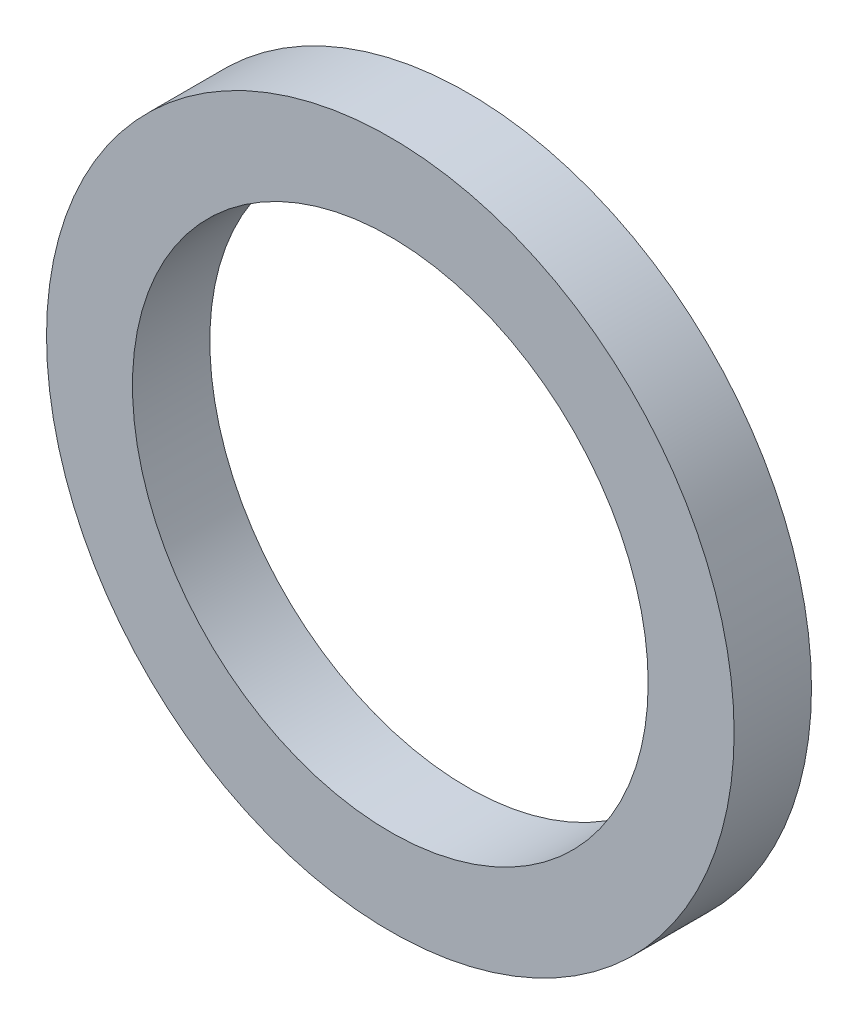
ISO-10303-21;
HEADER;
FILE_DESCRIPTION(('STEP AP214'),'2;1');
FILE_NAME('part.step','',(''),(''),'','','');
FILE_SCHEMA(('AUTOMOTIVE_DESIGN { 1 0 10303 214 1 1 1 1 }'));
ENDSEC;
DATA;
#1=APPLICATION_CONTEXT('core data for automotive mechanical design processes');
#2=APPLICATION_PROTOCOL_DEFINITION('international standard','automotive_design',2000,#1);
#3=PRODUCT_CONTEXT('',#1,'mechanical');
#4=PRODUCT('Part','Part','',(#3));
#5=PRODUCT_RELATED_PRODUCT_CATEGORY('part','',(#4));
#6=PRODUCT_DEFINITION_FORMATION('','',#4);
#7=PRODUCT_DEFINITION_CONTEXT('part definition',#1,'design');
#8=PRODUCT_DEFINITION('design','',#6,#7);
#9=PRODUCT_DEFINITION_SHAPE('','',#8);
#10=(LENGTH_UNIT() NAMED_UNIT(*) SI_UNIT(.MILLI.,.METRE.));
#11=(NAMED_UNIT(*) PLANE_ANGLE_UNIT() SI_UNIT($,.RADIAN.));
#12=(NAMED_UNIT(*) SI_UNIT($,.STERADIAN.) SOLID_ANGLE_UNIT());
#13=UNCERTAINTY_MEASURE_WITH_UNIT(LENGTH_MEASURE(1.E-05),#10,'distance_accuracy_value','');
#14=(GEOMETRIC_REPRESENTATION_CONTEXT(3) GLOBAL_UNCERTAINTY_ASSIGNED_CONTEXT((#13)) GLOBAL_UNIT_ASSIGNED_CONTEXT((#10,
#11,#12)) REPRESENTATION_CONTEXT('',''));
#15=CARTESIAN_POINT('',(0.,0.,0.));
#16=DIRECTION('',(0.,0.,1.));
#17=DIRECTION('',(1.,0.,0.));
#18=AXIS2_PLACEMENT_3D('',#15,#16,#17);
#19=CARTESIAN_POINT('',(0.,0.,4.5));
#20=DIRECTION('',(0.,0.,1.));
#21=DIRECTION('',(1.,0.,0.));
#22=AXIS2_PLACEMENT_3D('',#19,#20,#21);
#23=PLANE('',#22);
#24=CARTESIAN_POINT('',(0.,0.,4.5));
#25=DIRECTION('',(0.,0.,1.));
#26=DIRECTION('',(1.,0.,0.));
#27=AXIS2_PLACEMENT_3D('',#24,#25,#26);
#28=CIRCLE('',#27,20.);
#29=CARTESIAN_POINT('',(20.,0.,4.5));
#30=VERTEX_POINT('',#29);
#31=EDGE_CURVE('E10',#30,#30,#28,.T.);
#32=ORIENTED_EDGE('',*,*,#31,.T.);
#33=EDGE_LOOP('',(#32));
#34=FACE_BOUND('',#33,.T.);
#35=CARTESIAN_POINT('',(0.,0.,4.5));
#36=DIRECTION('',(0.,0.,1.));
#37=DIRECTION('',(1.,0.,0.));
#38=AXIS2_PLACEMENT_3D('',#35,#36,#37);
#39=CIRCLE('',#38,15.);
#40=CARTESIAN_POINT('',(15.,0.,4.5));
#41=VERTEX_POINT('',#40);
#42=EDGE_CURVE('E33',#41,#41,#39,.T.);
#43=ORIENTED_EDGE('',*,*,#42,.F.);
#44=EDGE_LOOP('',(#43));
#45=FACE_BOUND('',#44,.T.);
#46=ADVANCED_FACE('F22',(#34,#45),#23,.T.);
#47=CARTESIAN_POINT('',(0.,0.,0.));
#48=DIRECTION('',(0.,0.,1.));
#49=DIRECTION('',(1.,0.,0.));
#50=AXIS2_PLACEMENT_3D('',#47,#48,#49);
#51=PLANE('',#50);
#52=CARTESIAN_POINT('',(0.,0.,0.));
#53=DIRECTION('',(0.,0.,1.));
#54=DIRECTION('',(1.,0.,0.));
#55=AXIS2_PLACEMENT_3D('',#52,#53,#54);
#56=CIRCLE('',#55,20.);
#57=CARTESIAN_POINT('',(20.,0.,0.));
#58=VERTEX_POINT('',#57);
#59=EDGE_CURVE('E29',#58,#58,#56,.T.);
#60=ORIENTED_EDGE('',*,*,#59,.F.);
#61=EDGE_LOOP('',(#60));
#62=FACE_BOUND('',#61,.T.);
#63=CARTESIAN_POINT('',(0.,0.,0.));
#64=DIRECTION('',(0.,0.,1.));
#65=DIRECTION('',(1.,0.,0.));
#66=AXIS2_PLACEMENT_3D('',#63,#64,#65);
#67=CIRCLE('',#66,15.);
#68=CARTESIAN_POINT('',(15.,0.,0.));
#69=VERTEX_POINT('',#68);
#70=EDGE_CURVE('E37',#69,#69,#67,.T.);
#71=ORIENTED_EDGE('',*,*,#70,.T.);
#72=EDGE_LOOP('',(#71));
#73=FACE_BOUND('',#72,.T.);
#74=ADVANCED_FACE('F43',(#62,#73),#51,.F.);
#75=CARTESIAN_POINT('',(0.,0.,4.5));
#76=DIRECTION('',(0.,0.,-1.));
#77=DIRECTION('',(-1.,0.,0.));
#78=AXIS2_PLACEMENT_3D('',#75,#76,#77);
#79=CYLINDRICAL_SURFACE('',#78,20.);
#80=ORIENTED_EDGE('',*,*,#31,.F.);
#81=EDGE_LOOP('',(#80));
#82=FACE_BOUND('',#81,.T.);
#83=ORIENTED_EDGE('',*,*,#59,.T.);
#84=EDGE_LOOP('',(#83));
#85=FACE_BOUND('',#84,.T.);
#86=ADVANCED_FACE('F24',(#82,#85),#79,.T.);
#87=CARTESIAN_POINT('',(0.,0.,4.5));
#88=DIRECTION('',(0.,0.,-1.));
#89=DIRECTION('',(-1.,0.,0.));
#90=AXIS2_PLACEMENT_3D('',#87,#88,#89);
#91=CYLINDRICAL_SURFACE('',#90,15.);
#92=ORIENTED_EDGE('',*,*,#42,.T.);
#93=EDGE_LOOP('',(#92));
#94=FACE_BOUND('',#93,.T.);
#95=ORIENTED_EDGE('',*,*,#70,.F.);
#96=EDGE_LOOP('',(#95));
#97=FACE_BOUND('',#96,.T.);
#98=ADVANCED_FACE('F45',(#94,#97),#91,.F.);
#99=CLOSED_SHELL('',(#46,#74,#86,#98));
#100=MANIFOLD_SOLID_BREP('B2',#99);
#101=ADVANCED_BREP_SHAPE_REPRESENTATION('',(#18,#100),#14);
#102=SHAPE_DEFINITION_REPRESENTATION(#9,#101);
ENDSEC;
END-ISO-10303-21;
